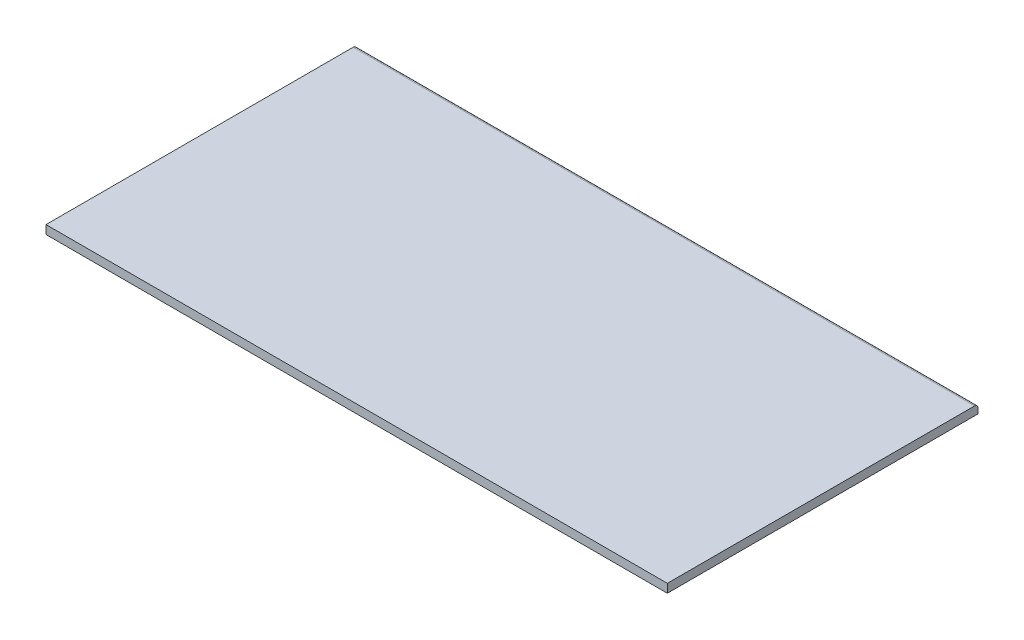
ISO-10303-21;
HEADER;
FILE_DESCRIPTION(('STEP AP214'),'2;1');
FILE_NAME('part.step','',(''),(''),'','','');
FILE_SCHEMA(('AUTOMOTIVE_DESIGN { 1 0 10303 214 1 1 1 1 }'));
ENDSEC;
DATA;
#1=APPLICATION_CONTEXT('core data for automotive mechanical design processes');
#2=APPLICATION_PROTOCOL_DEFINITION('international standard','automotive_design',2000,#1);
#3=PRODUCT_CONTEXT('',#1,'mechanical');
#4=PRODUCT('Part','Part','',(#3));
#5=PRODUCT_RELATED_PRODUCT_CATEGORY('part','',(#4));
#6=PRODUCT_DEFINITION_FORMATION('','',#4);
#7=PRODUCT_DEFINITION_CONTEXT('part definition',#1,'design');
#8=PRODUCT_DEFINITION('design','',#6,#7);
#9=PRODUCT_DEFINITION_SHAPE('','',#8);
#10=(LENGTH_UNIT() NAMED_UNIT(*) SI_UNIT(.MILLI.,.METRE.));
#11=(NAMED_UNIT(*) PLANE_ANGLE_UNIT() SI_UNIT($,.RADIAN.));
#12=(NAMED_UNIT(*) SI_UNIT($,.STERADIAN.) SOLID_ANGLE_UNIT());
#13=UNCERTAINTY_MEASURE_WITH_UNIT(LENGTH_MEASURE(1.E-05),#10,'distance_accuracy_value','');
#14=(GEOMETRIC_REPRESENTATION_CONTEXT(3) GLOBAL_UNCERTAINTY_ASSIGNED_CONTEXT((#13)) GLOBAL_UNIT_ASSIGNED_CONTEXT((#10,
#11,#12)) REPRESENTATION_CONTEXT('',''));
#15=CARTESIAN_POINT('',(0.,0.,0.));
#16=DIRECTION('',(0.,0.,1.));
#17=DIRECTION('',(1.,0.,0.));
#18=AXIS2_PLACEMENT_3D('',#15,#16,#17);
#19=CARTESIAN_POINT('',(-457.2,-12.7,-228.6));
#20=DIRECTION('',(-1.,0.,0.));
#21=DIRECTION('',(0.,0.,1.));
#22=AXIS2_PLACEMENT_3D('',#19,#20,#21);
#23=PLANE('',#22);
#24=DIRECTION('',(0.,0.,1.));
#25=VECTOR('',#24,1.);
#26=CARTESIAN_POINT('',(-457.2,0.,-228.6));
#27=LINE('',#26,#25);
#28=CARTESIAN_POINT('',(-457.2,0.,-223.52));
#29=VERTEX_POINT('',#28);
#30=CARTESIAN_POINT('',(-457.2,0.,228.6));
#31=VERTEX_POINT('',#30);
#32=EDGE_CURVE('E79',#29,#31,#27,.T.);
#33=ORIENTED_EDGE('',*,*,#32,.F.);
#34=CARTESIAN_POINT('',(-457.2,-5.08,-223.52));
#35=DIRECTION('',(-1.,0.,0.));
#36=DIRECTION('',(0.,0.,1.));
#37=AXIS2_PLACEMENT_3D('',#34,#35,#36);
#38=CIRCLE('',#37,5.08);
#39=CARTESIAN_POINT('',(-457.2,-5.08,-228.6));
#40=VERTEX_POINT('',#39);
#41=EDGE_CURVE('E56',#29,#40,#38,.T.);
#42=ORIENTED_EDGE('',*,*,#41,.T.);
#43=DIRECTION('',(0.,1.,0.));
#44=VECTOR('',#43,1.);
#45=CARTESIAN_POINT('',(-457.2,-12.7,-228.6));
#46=LINE('',#45,#44);
#47=CARTESIAN_POINT('',(-457.2,-12.7,-228.6));
#48=VERTEX_POINT('',#47);
#49=EDGE_CURVE('E112',#48,#40,#46,.T.);
#50=ORIENTED_EDGE('',*,*,#49,.F.);
#51=DIRECTION('',(0.,0.,1.));
#52=VECTOR('',#51,1.);
#53=CARTESIAN_POINT('',(-457.2,-12.7,-228.6));
#54=LINE('',#53,#52);
#55=CARTESIAN_POINT('',(-457.2,-12.7,228.6));
#56=VERTEX_POINT('',#55);
#57=EDGE_CURVE('E91',#48,#56,#54,.T.);
#58=ORIENTED_EDGE('',*,*,#57,.T.);
#59=DIRECTION('',(0.,1.,0.));
#60=VECTOR('',#59,1.);
#61=CARTESIAN_POINT('',(-457.2,-12.7,228.6));
#62=LINE('',#61,#60);
#63=EDGE_CURVE('E89',#56,#31,#62,.T.);
#64=ORIENTED_EDGE('',*,*,#63,.T.);
#65=EDGE_LOOP('',(#33,#42,#50,#58,#64));
#66=FACE_BOUND('',#65,.T.);
#67=ADVANCED_FACE('F35',(#66),#23,.T.);
#68=CARTESIAN_POINT('',(-457.2,-12.7,-228.6));
#69=DIRECTION('',(0.,0.,-1.));
#70=DIRECTION('',(-1.,0.,0.));
#71=AXIS2_PLACEMENT_3D('',#68,#69,#70);
#72=PLANE('',#71);
#73=ORIENTED_EDGE('',*,*,#49,.T.);
#74=DIRECTION('',(-1.,0.,0.));
#75=VECTOR('',#74,1.);
#76=CARTESIAN_POINT('',(-457.2,-5.08,-228.6));
#77=LINE('',#76,#75);
#78=CARTESIAN_POINT('',(457.2,-5.08,-228.6));
#79=VERTEX_POINT('',#78);
#80=EDGE_CURVE('E42',#40,#79,#77,.F.);
#81=ORIENTED_EDGE('',*,*,#80,.T.);
#82=DIRECTION('',(0.,1.,0.));
#83=VECTOR('',#82,1.);
#84=CARTESIAN_POINT('',(457.2,-12.7,-228.6));
#85=LINE('',#84,#83);
#86=CARTESIAN_POINT('',(457.2,-12.7,-228.6));
#87=VERTEX_POINT('',#86);
#88=EDGE_CURVE('E114',#87,#79,#85,.T.);
#89=ORIENTED_EDGE('',*,*,#88,.F.);
#90=DIRECTION('',(-1.,0.,0.));
#91=VECTOR('',#90,1.);
#92=CARTESIAN_POINT('',(-457.2,-12.7,-228.6));
#93=LINE('',#92,#91);
#94=EDGE_CURVE('E96',#87,#48,#93,.T.);
#95=ORIENTED_EDGE('',*,*,#94,.T.);
#96=EDGE_LOOP('',(#73,#81,#89,#95));
#97=FACE_BOUND('',#96,.T.);
#98=ADVANCED_FACE('F133',(#97),#72,.T.);
#99=CARTESIAN_POINT('',(457.2,-12.7,-228.6));
#100=DIRECTION('',(1.,0.,0.));
#101=DIRECTION('',(0.,0.,-1.));
#102=AXIS2_PLACEMENT_3D('',#99,#100,#101);
#103=PLANE('',#102);
#104=ORIENTED_EDGE('',*,*,#88,.T.);
#105=CARTESIAN_POINT('',(457.2,-5.08,-223.52));
#106=DIRECTION('',(1.,0.,0.));
#107=DIRECTION('',(0.,0.,-1.));
#108=AXIS2_PLACEMENT_3D('',#105,#106,#107);
#109=CIRCLE('',#108,5.08);
#110=CARTESIAN_POINT('',(457.2,0.,-223.52));
#111=VERTEX_POINT('',#110);
#112=EDGE_CURVE('E11',#79,#111,#109,.T.);
#113=ORIENTED_EDGE('',*,*,#112,.T.);
#114=DIRECTION('',(0.,0.,-1.));
#115=VECTOR('',#114,1.);
#116=CARTESIAN_POINT('',(457.2,0.,-228.6));
#117=LINE('',#116,#115);
#118=CARTESIAN_POINT('',(457.2,0.,228.6));
#119=VERTEX_POINT('',#118);
#120=EDGE_CURVE('E100',#119,#111,#117,.T.);
#121=ORIENTED_EDGE('',*,*,#120,.F.);
#122=DIRECTION('',(0.,1.,0.));
#123=VECTOR('',#122,1.);
#124=CARTESIAN_POINT('',(457.2,-12.7,228.6));
#125=LINE('',#124,#123);
#126=CARTESIAN_POINT('',(457.2,-12.7,228.6));
#127=VERTEX_POINT('',#126);
#128=EDGE_CURVE('E95',#127,#119,#125,.T.);
#129=ORIENTED_EDGE('',*,*,#128,.F.);
#130=DIRECTION('',(0.,0.,-1.));
#131=VECTOR('',#130,1.);
#132=CARTESIAN_POINT('',(457.2,-12.7,-228.6));
#133=LINE('',#132,#131);
#134=EDGE_CURVE('E107',#127,#87,#133,.T.);
#135=ORIENTED_EDGE('',*,*,#134,.T.);
#136=EDGE_LOOP('',(#104,#113,#121,#129,#135));
#137=FACE_BOUND('',#136,.T.);
#138=ADVANCED_FACE('F120',(#137),#103,.T.);
#139=CARTESIAN_POINT('',(-457.2,-12.7,228.6));
#140=DIRECTION('',(0.,0.,1.));
#141=DIRECTION('',(1.,0.,0.));
#142=AXIS2_PLACEMENT_3D('',#139,#140,#141);
#143=PLANE('',#142);
#144=DIRECTION('',(1.,0.,0.));
#145=VECTOR('',#144,1.);
#146=CARTESIAN_POINT('',(-457.2,0.,228.6));
#147=LINE('',#146,#145);
#148=EDGE_CURVE('E84',#31,#119,#147,.T.);
#149=ORIENTED_EDGE('',*,*,#148,.F.);
#150=ORIENTED_EDGE('',*,*,#63,.F.);
#151=DIRECTION('',(1.,0.,0.));
#152=VECTOR('',#151,1.);
#153=CARTESIAN_POINT('',(-457.2,-12.7,228.6));
#154=LINE('',#153,#152);
#155=EDGE_CURVE('E105',#56,#127,#154,.T.);
#156=ORIENTED_EDGE('',*,*,#155,.T.);
#157=ORIENTED_EDGE('',*,*,#128,.T.);
#158=EDGE_LOOP('',(#149,#150,#156,#157));
#159=FACE_BOUND('',#158,.T.);
#160=ADVANCED_FACE('F98',(#159),#143,.T.);
#161=CARTESIAN_POINT('',(-457.2,-12.7,228.6));
#162=DIRECTION('',(0.,1.,0.));
#163=DIRECTION('',(0.,0.,1.));
#164=AXIS2_PLACEMENT_3D('',#161,#162,#163);
#165=PLANE('',#164);
#166=ORIENTED_EDGE('',*,*,#57,.F.);
#167=ORIENTED_EDGE('',*,*,#94,.F.);
#168=ORIENTED_EDGE('',*,*,#134,.F.);
#169=ORIENTED_EDGE('',*,*,#155,.F.);
#170=EDGE_LOOP('',(#166,#167,#168,#169));
#171=FACE_BOUND('',#170,.T.);
#172=ADVANCED_FACE('F130',(#171),#165,.F.);
#173=CARTESIAN_POINT('',(-457.2,0.,228.6));
#174=DIRECTION('',(0.,1.,0.));
#175=DIRECTION('',(0.,0.,1.));
#176=AXIS2_PLACEMENT_3D('',#173,#174,#175);
#177=PLANE('',#176);
#178=ORIENTED_EDGE('',*,*,#120,.T.);
#179=DIRECTION('',(-1.,0.,0.));
#180=VECTOR('',#179,1.);
#181=CARTESIAN_POINT('',(-457.2,0.,-223.52));
#182=LINE('',#181,#180);
#183=EDGE_CURVE('E86',#111,#29,#182,.T.);
#184=ORIENTED_EDGE('',*,*,#183,.T.);
#185=ORIENTED_EDGE('',*,*,#32,.T.);
#186=ORIENTED_EDGE('',*,*,#148,.T.);
#187=EDGE_LOOP('',(#178,#184,#185,#186));
#188=FACE_BOUND('',#187,.T.);
#189=ADVANCED_FACE('F82',(#188),#177,.T.);
#190=CARTESIAN_POINT('',(-457.2,-5.08,-223.52));
#191=DIRECTION('',(-1.,0.,0.));
#192=DIRECTION('',(0.,0.,1.));
#193=AXIS2_PLACEMENT_3D('',#190,#191,#192);
#194=CYLINDRICAL_SURFACE('',#193,5.08);
#195=ORIENTED_EDGE('',*,*,#112,.F.);
#196=ORIENTED_EDGE('',*,*,#80,.F.);
#197=ORIENTED_EDGE('',*,*,#41,.F.);
#198=ORIENTED_EDGE('',*,*,#183,.F.);
#199=EDGE_LOOP('',(#195,#196,#197,#198));
#200=FACE_BOUND('',#199,.T.);
#201=ADVANCED_FACE('F124',(#200),#194,.T.);
#202=CLOSED_SHELL('',(#67,#98,#138,#160,#172,#189,#201));
#203=MANIFOLD_SOLID_BREP('B2',#202);
#204=ADVANCED_BREP_SHAPE_REPRESENTATION('',(#18,#203),#14);
#205=SHAPE_DEFINITION_REPRESENTATION(#9,#204);
ENDSEC;
END-ISO-10303-21;
